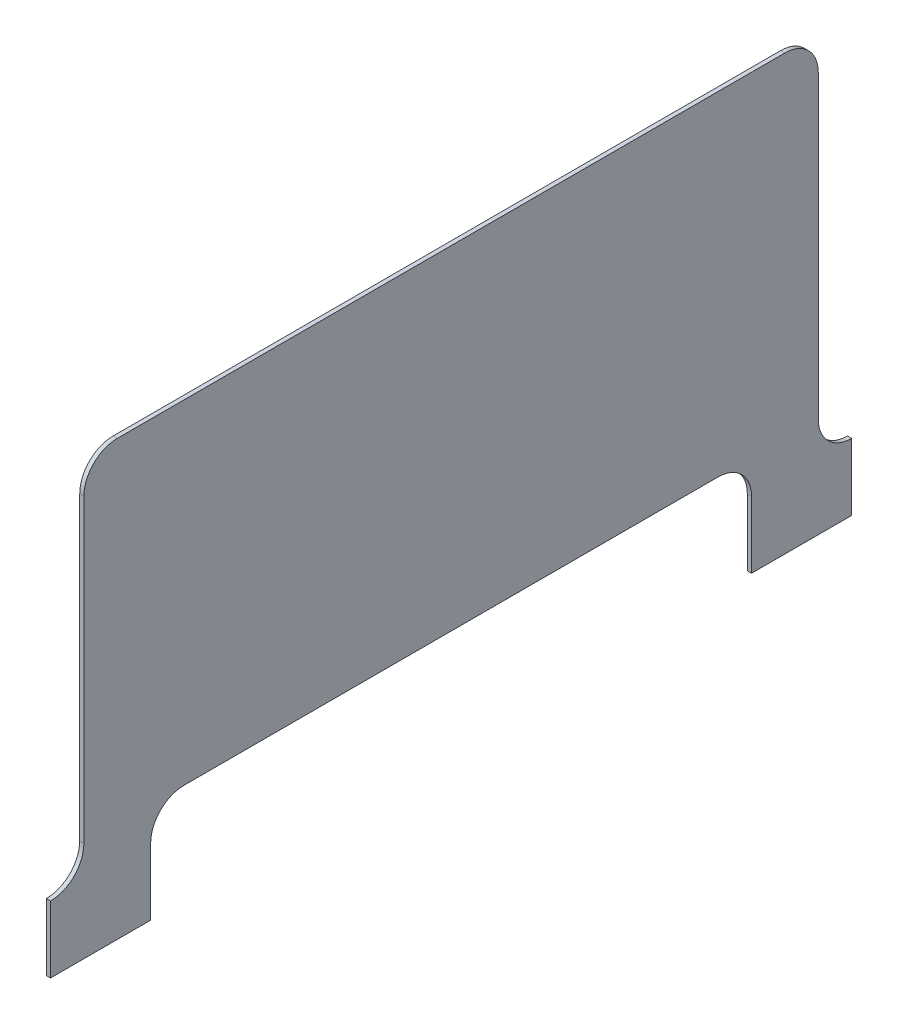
ISO-10303-21;
HEADER;
FILE_DESCRIPTION(('STEP AP214'),'2;1');
FILE_NAME('part.step','',(''),(''),'','','');
FILE_SCHEMA(('AUTOMOTIVE_DESIGN { 1 0 10303 214 1 1 1 1 }'));
ENDSEC;
DATA;
#1=APPLICATION_CONTEXT('core data for automotive mechanical design processes');
#2=APPLICATION_PROTOCOL_DEFINITION('international standard','automotive_design',2000,#1);
#3=PRODUCT_CONTEXT('',#1,'mechanical');
#4=PRODUCT('Part','Part','',(#3));
#5=PRODUCT_RELATED_PRODUCT_CATEGORY('part','',(#4));
#6=PRODUCT_DEFINITION_FORMATION('','',#4);
#7=PRODUCT_DEFINITION_CONTEXT('part definition',#1,'design');
#8=PRODUCT_DEFINITION('design','',#6,#7);
#9=PRODUCT_DEFINITION_SHAPE('','',#8);
#10=(LENGTH_UNIT() NAMED_UNIT(*) SI_UNIT(.MILLI.,.METRE.));
#11=(NAMED_UNIT(*) PLANE_ANGLE_UNIT() SI_UNIT($,.RADIAN.));
#12=(NAMED_UNIT(*) SI_UNIT($,.STERADIAN.) SOLID_ANGLE_UNIT());
#13=UNCERTAINTY_MEASURE_WITH_UNIT(LENGTH_MEASURE(1.E-05),#10,'distance_accuracy_value','');
#14=(GEOMETRIC_REPRESENTATION_CONTEXT(3) GLOBAL_UNCERTAINTY_ASSIGNED_CONTEXT((#13)) GLOBAL_UNIT_ASSIGNED_CONTEXT((#10,
#11,#12)) REPRESENTATION_CONTEXT('',''));
#15=CARTESIAN_POINT('',(0.,0.,0.));
#16=DIRECTION('',(0.,0.,1.));
#17=DIRECTION('',(1.,0.,0.));
#18=AXIS2_PLACEMENT_3D('',#15,#16,#17);
#19=CARTESIAN_POINT('',(-79.375,0.,304.8));
#20=DIRECTION('',(0.,1.,0.));
#21=DIRECTION('',(0.,0.,1.));
#22=AXIS2_PLACEMENT_3D('',#19,#20,#21);
#23=PLANE('',#22);
#24=DIRECTION('',(0.,0.,-1.));
#25=VECTOR('',#24,1.);
#26=CARTESIAN_POINT('',(-76.2,0.,304.8));
#27=LINE('',#26,#25);
#28=CARTESIAN_POINT('',(-76.1999999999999,0.,-228.6));
#29=VERTEX_POINT('',#28);
#30=CARTESIAN_POINT('',(-76.2,0.,-304.8));
#31=VERTEX_POINT('',#30);
#32=EDGE_CURVE('E149',#29,#31,#27,.T.);
#33=ORIENTED_EDGE('',*,*,#32,.F.);
#34=DIRECTION('',(-1.,0.,0.));
#35=VECTOR('',#34,1.);
#36=CARTESIAN_POINT('',(-76.1999999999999,0.,-228.6));
#37=LINE('',#36,#35);
#38=CARTESIAN_POINT('',(-79.375,0.,-228.6));
#39=VERTEX_POINT('',#38);
#40=EDGE_CURVE('E160',#29,#39,#37,.T.);
#41=ORIENTED_EDGE('',*,*,#40,.T.);
#42=DIRECTION('',(0.,0.,-1.));
#43=VECTOR('',#42,1.);
#44=CARTESIAN_POINT('',(-79.375,0.,304.8));
#45=LINE('',#44,#43);
#46=CARTESIAN_POINT('',(-79.375,0.,-304.8));
#47=VERTEX_POINT('',#46);
#48=EDGE_CURVE('E176',#39,#47,#45,.T.);
#49=ORIENTED_EDGE('',*,*,#48,.T.);
#50=DIRECTION('',(1.,0.,0.));
#51=VECTOR('',#50,1.);
#52=CARTESIAN_POINT('',(-79.375,0.,-304.8));
#53=LINE('',#52,#51);
#54=EDGE_CURVE('E170',#47,#31,#53,.T.);
#55=ORIENTED_EDGE('',*,*,#54,.T.);
#56=EDGE_LOOP('',(#33,#41,#49,#55));
#57=FACE_BOUND('',#56,.T.);
#58=ADVANCED_FACE('F31',(#57),#23,.F.);
#59=CARTESIAN_POINT('',(-79.375,330.2,304.8));
#60=DIRECTION('',(1.,0.,0.));
#61=DIRECTION('',(0.,1.,0.));
#62=AXIS2_PLACEMENT_3D('',#59,#60,#61);
#63=PLANE('',#62);
#64=DIRECTION('',(0.,0.,-1.));
#65=VECTOR('',#64,1.);
#66=CARTESIAN_POINT('',(-79.375,330.2,304.8));
#67=LINE('',#66,#65);
#68=CARTESIAN_POINT('',(-79.375,330.2,254.));
#69=VERTEX_POINT('',#68);
#70=CARTESIAN_POINT('',(-79.375,330.2,-254.));
#71=VERTEX_POINT('',#70);
#72=EDGE_CURVE('E178',#69,#71,#67,.T.);
#73=ORIENTED_EDGE('',*,*,#72,.T.);
#74=CARTESIAN_POINT('',(-79.375,304.8,-254.));
#75=DIRECTION('',(1.,0.,0.));
#76=DIRECTION('',(0.,1.,0.));
#77=AXIS2_PLACEMENT_3D('',#74,#75,#76);
#78=CIRCLE('',#77,25.4);
#79=CARTESIAN_POINT('',(-79.375,304.8,-279.4));
#80=VERTEX_POINT('',#79);
#81=EDGE_CURVE('E192',#71,#80,#78,.F.);
#82=ORIENTED_EDGE('',*,*,#81,.T.);
#83=DIRECTION('',(0.,1.,0.));
#84=VECTOR('',#83,1.);
#85=CARTESIAN_POINT('',(-79.375,330.2,-279.4));
#86=LINE('',#85,#84);
#87=CARTESIAN_POINT('',(-79.375,76.2,-279.4));
#88=VERTEX_POINT('',#87);
#89=EDGE_CURVE('E266',#88,#80,#86,.T.);
#90=ORIENTED_EDGE('',*,*,#89,.F.);
#91=CARTESIAN_POINT('',(-79.375,76.2,-304.8));
#92=DIRECTION('',(-1.,0.,0.));
#93=DIRECTION('',(0.,1.,0.));
#94=AXIS2_PLACEMENT_3D('',#91,#92,#93);
#95=CIRCLE('',#94,25.4);
#96=CARTESIAN_POINT('',(-79.375,50.8,-304.8));
#97=VERTEX_POINT('',#96);
#98=EDGE_CURVE('E260',#97,#88,#95,.T.);
#99=ORIENTED_EDGE('',*,*,#98,.F.);
#100=DIRECTION('',(0.,-1.,0.));
#101=VECTOR('',#100,1.);
#102=CARTESIAN_POINT('',(-79.375,330.2,-304.8));
#103=LINE('',#102,#101);
#104=EDGE_CURVE('E289',#97,#47,#103,.T.);
#105=ORIENTED_EDGE('',*,*,#104,.T.);
#106=ORIENTED_EDGE('',*,*,#48,.F.);
#107=DIRECTION('',(0.,-1.,0.));
#108=VECTOR('',#107,1.);
#109=CARTESIAN_POINT('',(-79.375,0.,-228.6));
#110=LINE('',#109,#108);
#111=CARTESIAN_POINT('',(-79.375,50.8,-228.6));
#112=VERTEX_POINT('',#111);
#113=EDGE_CURVE('E163',#112,#39,#110,.T.);
#114=ORIENTED_EDGE('',*,*,#113,.F.);
#115=CARTESIAN_POINT('',(-79.375,50.8,-203.2));
#116=DIRECTION('',(1.,0.,0.));
#117=DIRECTION('',(0.,1.,0.));
#118=AXIS2_PLACEMENT_3D('',#115,#116,#117);
#119=CIRCLE('',#118,25.4);
#120=CARTESIAN_POINT('',(-79.375,76.2,-203.2));
#121=VERTEX_POINT('',#120);
#122=EDGE_CURVE('E39',#112,#121,#119,.T.);
#123=ORIENTED_EDGE('',*,*,#122,.T.);
#124=DIRECTION('',(0.,0.,-1.));
#125=VECTOR('',#124,1.);
#126=CARTESIAN_POINT('',(-79.375,76.2,-228.6));
#127=LINE('',#126,#125);
#128=CARTESIAN_POINT('',(-79.375,76.2,203.2));
#129=VERTEX_POINT('',#128);
#130=EDGE_CURVE('E157',#129,#121,#127,.T.);
#131=ORIENTED_EDGE('',*,*,#130,.F.);
#132=CARTESIAN_POINT('',(-79.375,50.8,203.2));
#133=DIRECTION('',(1.,0.,0.));
#134=DIRECTION('',(0.,1.,0.));
#135=AXIS2_PLACEMENT_3D('',#132,#133,#134);
#136=CIRCLE('',#135,25.4);
#137=CARTESIAN_POINT('',(-79.375,50.8,228.6));
#138=VERTEX_POINT('',#137);
#139=EDGE_CURVE('E210',#129,#138,#136,.T.);
#140=ORIENTED_EDGE('',*,*,#139,.T.);
#141=DIRECTION('',(0.,1.,0.));
#142=VECTOR('',#141,1.);
#143=CARTESIAN_POINT('',(-79.375,0.,228.6));
#144=LINE('',#143,#142);
#145=CARTESIAN_POINT('',(-79.375,0.,228.6));
#146=VERTEX_POINT('',#145);
#147=EDGE_CURVE('E224',#146,#138,#144,.T.);
#148=ORIENTED_EDGE('',*,*,#147,.F.);
#149=CARTESIAN_POINT('',(-79.375,0.,304.8));
#150=VERTEX_POINT('',#149);
#151=EDGE_CURVE('E182',#150,#146,#45,.T.);
#152=ORIENTED_EDGE('',*,*,#151,.F.);
#153=DIRECTION('',(0.,-1.,0.));
#154=VECTOR('',#153,1.);
#155=CARTESIAN_POINT('',(-79.375,330.2,304.8));
#156=LINE('',#155,#154);
#157=CARTESIAN_POINT('',(-79.375,50.8000000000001,304.8));
#158=VERTEX_POINT('',#157);
#159=EDGE_CURVE('E255',#158,#150,#156,.T.);
#160=ORIENTED_EDGE('',*,*,#159,.F.);
#161=CARTESIAN_POINT('',(-79.375,76.2,304.8));
#162=DIRECTION('',(-1.,0.,0.));
#163=DIRECTION('',(0.,-1.,0.));
#164=AXIS2_PLACEMENT_3D('',#161,#162,#163);
#165=CIRCLE('',#164,25.4);
#166=CARTESIAN_POINT('',(-79.375,76.2,279.4));
#167=VERTEX_POINT('',#166);
#168=EDGE_CURVE('E280',#167,#158,#165,.T.);
#169=ORIENTED_EDGE('',*,*,#168,.F.);
#170=DIRECTION('',(0.,-1.,0.));
#171=VECTOR('',#170,1.);
#172=CARTESIAN_POINT('',(-79.375,330.2,279.4));
#173=LINE('',#172,#171);
#174=CARTESIAN_POINT('',(-79.375,304.8,279.4));
#175=VERTEX_POINT('',#174);
#176=EDGE_CURVE('E275',#175,#167,#173,.T.);
#177=ORIENTED_EDGE('',*,*,#176,.F.);
#178=CARTESIAN_POINT('',(-79.375,304.8,254.));
#179=DIRECTION('',(1.,0.,0.));
#180=DIRECTION('',(0.,1.,0.));
#181=AXIS2_PLACEMENT_3D('',#178,#179,#180);
#182=CIRCLE('',#181,25.4);
#183=EDGE_CURVE('E190',#175,#69,#182,.F.);
#184=ORIENTED_EDGE('',*,*,#183,.T.);
#185=EDGE_LOOP('',(#73,#82,#90,#99,#105,#106,#114,#123,#131,#140,#148,#152,#160,#169,#177,#184));
#186=FACE_BOUND('',#185,.T.);
#187=ADVANCED_FACE('F217',(#186),#63,.F.);
#188=ORIENTED_EDGE('',*,*,#151,.T.);
#189=DIRECTION('',(-1.,0.,0.));
#190=VECTOR('',#189,1.);
#191=CARTESIAN_POINT('',(-76.1999999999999,0.,228.6));
#192=LINE('',#191,#190);
#193=CARTESIAN_POINT('',(-76.1999999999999,0.,228.6));
#194=VERTEX_POINT('',#193);
#195=EDGE_CURVE('E166',#194,#146,#192,.T.);
#196=ORIENTED_EDGE('',*,*,#195,.F.);
#197=CARTESIAN_POINT('',(-76.2,0.,304.8));
#198=VERTEX_POINT('',#197);
#199=EDGE_CURVE('E172',#198,#194,#27,.T.);
#200=ORIENTED_EDGE('',*,*,#199,.F.);
#201=DIRECTION('',(1.,0.,0.));
#202=VECTOR('',#201,1.);
#203=CARTESIAN_POINT('',(-79.375,0.,304.8));
#204=LINE('',#203,#202);
#205=EDGE_CURVE('E251',#150,#198,#204,.T.);
#206=ORIENTED_EDGE('',*,*,#205,.F.);
#207=EDGE_LOOP('',(#188,#196,#200,#206));
#208=FACE_BOUND('',#207,.T.);
#209=ADVANCED_FACE('F235',(#208),#23,.F.);
#210=CARTESIAN_POINT('',(-76.2,330.2,304.8));
#211=DIRECTION('',(-1.,0.,0.));
#212=DIRECTION('',(0.,-1.,0.));
#213=AXIS2_PLACEMENT_3D('',#210,#211,#212);
#214=PLANE('',#213);
#215=DIRECTION('',(0.,1.,0.));
#216=VECTOR('',#215,1.);
#217=CARTESIAN_POINT('',(-76.2,330.2,-279.4));
#218=LINE('',#217,#216);
#219=CARTESIAN_POINT('',(-76.2,76.2,-279.4));
#220=VERTEX_POINT('',#219);
#221=CARTESIAN_POINT('',(-76.2,304.8,-279.4));
#222=VERTEX_POINT('',#221);
#223=EDGE_CURVE('E265',#220,#222,#218,.T.);
#224=ORIENTED_EDGE('',*,*,#223,.T.);
#225=CARTESIAN_POINT('',(-76.2,304.8,-254.));
#226=DIRECTION('',(-1.,0.,0.));
#227=DIRECTION('',(0.,-1.,0.));
#228=AXIS2_PLACEMENT_3D('',#225,#226,#227);
#229=CIRCLE('',#228,25.4);
#230=CARTESIAN_POINT('',(-76.2,330.2,-254.));
#231=VERTEX_POINT('',#230);
#232=EDGE_CURVE('E197',#222,#231,#229,.F.);
#233=ORIENTED_EDGE('',*,*,#232,.T.);
#234=DIRECTION('',(0.,0.,-1.));
#235=VECTOR('',#234,1.);
#236=CARTESIAN_POINT('',(-76.2,330.2,304.8));
#237=LINE('',#236,#235);
#238=CARTESIAN_POINT('',(-76.2,330.2,254.));
#239=VERTEX_POINT('',#238);
#240=EDGE_CURVE('E173',#239,#231,#237,.T.);
#241=ORIENTED_EDGE('',*,*,#240,.F.);
#242=CARTESIAN_POINT('',(-76.2,304.8,254.));
#243=DIRECTION('',(-1.,0.,0.));
#244=DIRECTION('',(0.,-1.,0.));
#245=AXIS2_PLACEMENT_3D('',#242,#243,#244);
#246=CIRCLE('',#245,25.4);
#247=CARTESIAN_POINT('',(-76.2,304.8,279.4));
#248=VERTEX_POINT('',#247);
#249=EDGE_CURVE('E54',#239,#248,#246,.F.);
#250=ORIENTED_EDGE('',*,*,#249,.T.);
#251=DIRECTION('',(0.,-1.,0.));
#252=VECTOR('',#251,1.);
#253=CARTESIAN_POINT('',(-76.2,330.2,279.4));
#254=LINE('',#253,#252);
#255=CARTESIAN_POINT('',(-76.2,76.2,279.4));
#256=VERTEX_POINT('',#255);
#257=EDGE_CURVE('E277',#248,#256,#254,.T.);
#258=ORIENTED_EDGE('',*,*,#257,.T.);
#259=CARTESIAN_POINT('',(-76.2,76.2,304.8));
#260=DIRECTION('',(-1.,0.,0.));
#261=DIRECTION('',(0.,-1.,0.));
#262=AXIS2_PLACEMENT_3D('',#259,#260,#261);
#263=CIRCLE('',#262,25.4);
#264=CARTESIAN_POINT('',(-76.2,50.7999999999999,304.8));
#265=VERTEX_POINT('',#264);
#266=EDGE_CURVE('E279',#256,#265,#263,.T.);
#267=ORIENTED_EDGE('',*,*,#266,.T.);
#268=DIRECTION('',(0.,1.,0.));
#269=VECTOR('',#268,1.);
#270=CARTESIAN_POINT('',(-76.2,330.2,304.8));
#271=LINE('',#270,#269);
#272=EDGE_CURVE('E295',#198,#265,#271,.T.);
#273=ORIENTED_EDGE('',*,*,#272,.F.);
#274=ORIENTED_EDGE('',*,*,#199,.T.);
#275=DIRECTION('',(0.,1.,0.));
#276=VECTOR('',#275,1.);
#277=CARTESIAN_POINT('',(-76.1999999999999,0.,228.6));
#278=LINE('',#277,#276);
#279=CARTESIAN_POINT('',(-76.1999999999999,50.8,228.6));
#280=VERTEX_POINT('',#279);
#281=EDGE_CURVE('E156',#194,#280,#278,.T.);
#282=ORIENTED_EDGE('',*,*,#281,.T.);
#283=CARTESIAN_POINT('',(-76.2,50.8,203.2));
#284=DIRECTION('',(-1.,0.,0.));
#285=DIRECTION('',(0.,-1.,0.));
#286=AXIS2_PLACEMENT_3D('',#283,#284,#285);
#287=CIRCLE('',#286,25.4);
#288=CARTESIAN_POINT('',(-76.1999999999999,76.2,203.2));
#289=VERTEX_POINT('',#288);
#290=EDGE_CURVE('E212',#280,#289,#287,.T.);
#291=ORIENTED_EDGE('',*,*,#290,.T.);
#292=DIRECTION('',(0.,0.,-1.));
#293=VECTOR('',#292,1.);
#294=CARTESIAN_POINT('',(-76.1999999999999,76.2,-228.6));
#295=LINE('',#294,#293);
#296=CARTESIAN_POINT('',(-76.1999999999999,76.2,-203.2));
#297=VERTEX_POINT('',#296);
#298=EDGE_CURVE('E167',#289,#297,#295,.T.);
#299=ORIENTED_EDGE('',*,*,#298,.T.);
#300=CARTESIAN_POINT('',(-76.2,50.8,-203.2));
#301=DIRECTION('',(-1.,0.,0.));
#302=DIRECTION('',(0.,-1.,0.));
#303=AXIS2_PLACEMENT_3D('',#300,#301,#302);
#304=CIRCLE('',#303,25.4);
#305=CARTESIAN_POINT('',(-76.1999999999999,50.8,-228.6));
#306=VERTEX_POINT('',#305);
#307=EDGE_CURVE('E11',#297,#306,#304,.T.);
#308=ORIENTED_EDGE('',*,*,#307,.T.);
#309=DIRECTION('',(0.,-1.,0.));
#310=VECTOR('',#309,1.);
#311=CARTESIAN_POINT('',(-76.1999999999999,0.,-228.6));
#312=LINE('',#311,#310);
#313=EDGE_CURVE('E143',#306,#29,#312,.T.);
#314=ORIENTED_EDGE('',*,*,#313,.T.);
#315=ORIENTED_EDGE('',*,*,#32,.T.);
#316=DIRECTION('',(0.,1.,0.));
#317=VECTOR('',#316,1.);
#318=CARTESIAN_POINT('',(-76.2,330.2,-304.8));
#319=LINE('',#318,#317);
#320=CARTESIAN_POINT('',(-76.2,50.8000000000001,-304.8));
#321=VERTEX_POINT('',#320);
#322=EDGE_CURVE('E293',#31,#321,#319,.T.);
#323=ORIENTED_EDGE('',*,*,#322,.T.);
#324=CARTESIAN_POINT('',(-76.2,76.2,-304.8));
#325=DIRECTION('',(-1.,0.,0.));
#326=DIRECTION('',(0.,1.,0.));
#327=AXIS2_PLACEMENT_3D('',#324,#325,#326);
#328=CIRCLE('',#327,25.4);
#329=EDGE_CURVE('E262',#321,#220,#328,.T.);
#330=ORIENTED_EDGE('',*,*,#329,.T.);
#331=EDGE_LOOP('',(#224,#233,#241,#250,#258,#267,#273,#274,#282,#291,#299,#308,#314,#315,#323,#330));
#332=FACE_BOUND('',#331,.T.);
#333=ADVANCED_FACE('F146',(#332),#214,.F.);
#334=CARTESIAN_POINT('',(-79.375,330.2,304.8));
#335=DIRECTION('',(0.,-1.,0.));
#336=DIRECTION('',(0.,0.,-1.));
#337=AXIS2_PLACEMENT_3D('',#334,#335,#336);
#338=PLANE('',#337);
#339=ORIENTED_EDGE('',*,*,#240,.T.);
#340=DIRECTION('',(-1.,0.,0.));
#341=VECTOR('',#340,1.);
#342=CARTESIAN_POINT('',(-79.375,330.2,-254.));
#343=LINE('',#342,#341);
#344=EDGE_CURVE('E187',#231,#71,#343,.T.);
#345=ORIENTED_EDGE('',*,*,#344,.T.);
#346=ORIENTED_EDGE('',*,*,#72,.F.);
#347=DIRECTION('',(-1.,0.,0.));
#348=VECTOR('',#347,1.);
#349=CARTESIAN_POINT('',(-79.375,330.2,254.));
#350=LINE('',#349,#348);
#351=EDGE_CURVE('E185',#69,#239,#350,.F.);
#352=ORIENTED_EDGE('',*,*,#351,.T.);
#353=EDGE_LOOP('',(#339,#345,#346,#352));
#354=FACE_BOUND('',#353,.T.);
#355=ADVANCED_FACE('F246',(#354),#338,.F.);
#356=CARTESIAN_POINT('',(-79.375,0.,304.8));
#357=DIRECTION('',(0.,0.,1.));
#358=DIRECTION('',(1.,0.,0.));
#359=AXIS2_PLACEMENT_3D('',#356,#357,#358);
#360=PLANE('',#359);
#361=DIRECTION('',(-1.,0.,0.));
#362=VECTOR('',#361,1.);
#363=CARTESIAN_POINT('',(-76.2,50.7999999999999,304.8));
#364=LINE('',#363,#362);
#365=EDGE_CURVE('E286',#265,#158,#364,.T.);
#366=ORIENTED_EDGE('',*,*,#365,.T.);
#367=ORIENTED_EDGE('',*,*,#159,.T.);
#368=ORIENTED_EDGE('',*,*,#205,.T.);
#369=ORIENTED_EDGE('',*,*,#272,.T.);
#370=EDGE_LOOP('',(#366,#367,#368,#369));
#371=FACE_BOUND('',#370,.T.);
#372=ADVANCED_FACE('F316',(#371),#360,.T.);
#373=CARTESIAN_POINT('',(-79.375,0.,-304.8));
#374=DIRECTION('',(0.,0.,1.));
#375=DIRECTION('',(1.,0.,0.));
#376=AXIS2_PLACEMENT_3D('',#373,#374,#375);
#377=PLANE('',#376);
#378=ORIENTED_EDGE('',*,*,#104,.F.);
#379=DIRECTION('',(-1.,0.,0.));
#380=VECTOR('',#379,1.);
#381=CARTESIAN_POINT('',(-76.2,50.8,-304.8));
#382=LINE('',#381,#380);
#383=EDGE_CURVE('E273',#321,#97,#382,.T.);
#384=ORIENTED_EDGE('',*,*,#383,.F.);
#385=ORIENTED_EDGE('',*,*,#322,.F.);
#386=ORIENTED_EDGE('',*,*,#54,.F.);
#387=EDGE_LOOP('',(#378,#384,#385,#386));
#388=FACE_BOUND('',#387,.T.);
#389=ADVANCED_FACE('F344',(#388),#377,.F.);
#390=CARTESIAN_POINT('',(-76.2,76.2,304.8));
#391=DIRECTION('',(-1.,0.,0.));
#392=DIRECTION('',(0.,-1.,0.));
#393=AXIS2_PLACEMENT_3D('',#390,#391,#392);
#394=CYLINDRICAL_SURFACE('',#393,25.4);
#395=ORIENTED_EDGE('',*,*,#168,.T.);
#396=ORIENTED_EDGE('',*,*,#365,.F.);
#397=ORIENTED_EDGE('',*,*,#266,.F.);
#398=DIRECTION('',(-1.,0.,0.));
#399=VECTOR('',#398,1.);
#400=CARTESIAN_POINT('',(-76.2,76.2,279.4));
#401=LINE('',#400,#399);
#402=EDGE_CURVE('E283',#256,#167,#401,.T.);
#403=ORIENTED_EDGE('',*,*,#402,.T.);
#404=EDGE_LOOP('',(#395,#396,#397,#403));
#405=FACE_BOUND('',#404,.T.);
#406=ADVANCED_FACE('F313',(#405),#394,.F.);
#407=CARTESIAN_POINT('',(-76.2,330.2,279.4));
#408=DIRECTION('',(0.,0.,-1.));
#409=DIRECTION('',(0.,1.,0.));
#410=AXIS2_PLACEMENT_3D('',#407,#408,#409);
#411=PLANE('',#410);
#412=ORIENTED_EDGE('',*,*,#257,.F.);
#413=DIRECTION('',(-1.,0.,0.));
#414=VECTOR('',#413,1.);
#415=CARTESIAN_POINT('',(-76.2,304.8,279.4));
#416=LINE('',#415,#414);
#417=EDGE_CURVE('E199',#248,#175,#416,.T.);
#418=ORIENTED_EDGE('',*,*,#417,.T.);
#419=ORIENTED_EDGE('',*,*,#176,.T.);
#420=ORIENTED_EDGE('',*,*,#402,.F.);
#421=EDGE_LOOP('',(#412,#418,#419,#420));
#422=FACE_BOUND('',#421,.T.);
#423=ADVANCED_FACE('F310',(#422),#411,.F.);
#424=CARTESIAN_POINT('',(-76.2,76.2,-304.8));
#425=DIRECTION('',(-1.,0.,0.));
#426=DIRECTION('',(0.,-1.,0.));
#427=AXIS2_PLACEMENT_3D('',#424,#425,#426);
#428=CYLINDRICAL_SURFACE('',#427,25.4);
#429=ORIENTED_EDGE('',*,*,#98,.T.);
#430=DIRECTION('',(-1.,0.,0.));
#431=VECTOR('',#430,1.);
#432=CARTESIAN_POINT('',(-76.2,76.2,-279.4));
#433=LINE('',#432,#431);
#434=EDGE_CURVE('E268',#220,#88,#433,.T.);
#435=ORIENTED_EDGE('',*,*,#434,.F.);
#436=ORIENTED_EDGE('',*,*,#329,.F.);
#437=ORIENTED_EDGE('',*,*,#383,.T.);
#438=EDGE_LOOP('',(#429,#435,#436,#437));
#439=FACE_BOUND('',#438,.T.);
#440=ADVANCED_FACE('F337',(#439),#428,.F.);
#441=CARTESIAN_POINT('',(-76.2,330.2,-279.4));
#442=DIRECTION('',(0.,0.,1.));
#443=DIRECTION('',(0.,-1.,0.));
#444=AXIS2_PLACEMENT_3D('',#441,#442,#443);
#445=PLANE('',#444);
#446=ORIENTED_EDGE('',*,*,#89,.T.);
#447=DIRECTION('',(-1.,0.,0.));
#448=VECTOR('',#447,1.);
#449=CARTESIAN_POINT('',(-76.2,304.8,-279.4));
#450=LINE('',#449,#448);
#451=EDGE_CURVE('E194',#80,#222,#450,.F.);
#452=ORIENTED_EDGE('',*,*,#451,.T.);
#453=ORIENTED_EDGE('',*,*,#223,.F.);
#454=ORIENTED_EDGE('',*,*,#434,.T.);
#455=EDGE_LOOP('',(#446,#452,#453,#454));
#456=FACE_BOUND('',#455,.T.);
#457=ADVANCED_FACE('F334',(#456),#445,.F.);
#458=CARTESIAN_POINT('',(-76.1999999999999,0.,-228.6));
#459=DIRECTION('',(0.,0.,-1.));
#460=DIRECTION('',(-1.,0.,0.));
#461=AXIS2_PLACEMENT_3D('',#458,#459,#460);
#462=PLANE('',#461);
#463=ORIENTED_EDGE('',*,*,#313,.F.);
#464=DIRECTION('',(-1.,0.,0.));
#465=VECTOR('',#464,1.);
#466=CARTESIAN_POINT('',(-79.375,50.8,-228.6));
#467=LINE('',#466,#465);
#468=EDGE_CURVE('E208',#306,#112,#467,.T.);
#469=ORIENTED_EDGE('',*,*,#468,.T.);
#470=ORIENTED_EDGE('',*,*,#113,.T.);
#471=ORIENTED_EDGE('',*,*,#40,.F.);
#472=EDGE_LOOP('',(#463,#469,#470,#471));
#473=FACE_BOUND('',#472,.T.);
#474=ADVANCED_FACE('F161',(#473),#462,.F.);
#475=CARTESIAN_POINT('',(-76.1999999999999,76.2,-228.6));
#476=DIRECTION('',(0.,1.,0.));
#477=DIRECTION('',(0.,0.,1.));
#478=AXIS2_PLACEMENT_3D('',#475,#476,#477);
#479=PLANE('',#478);
#480=ORIENTED_EDGE('',*,*,#298,.F.);
#481=DIRECTION('',(-1.,0.,0.));
#482=VECTOR('',#481,1.);
#483=CARTESIAN_POINT('',(-79.375,76.2,203.2));
#484=LINE('',#483,#482);
#485=EDGE_CURVE('E204',#289,#129,#484,.T.);
#486=ORIENTED_EDGE('',*,*,#485,.T.);
#487=ORIENTED_EDGE('',*,*,#130,.T.);
#488=DIRECTION('',(-1.,0.,0.));
#489=VECTOR('',#488,1.);
#490=CARTESIAN_POINT('',(-76.1999999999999,76.2,-203.2));
#491=LINE('',#490,#489);
#492=EDGE_CURVE('E202',#121,#297,#491,.F.);
#493=ORIENTED_EDGE('',*,*,#492,.T.);
#494=EDGE_LOOP('',(#480,#486,#487,#493));
#495=FACE_BOUND('',#494,.T.);
#496=ADVANCED_FACE('F222',(#495),#479,.F.);
#497=CARTESIAN_POINT('',(-76.1999999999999,0.,228.6));
#498=DIRECTION('',(0.,0.,1.));
#499=DIRECTION('',(0.,-1.,0.));
#500=AXIS2_PLACEMENT_3D('',#497,#498,#499);
#501=PLANE('',#500);
#502=ORIENTED_EDGE('',*,*,#147,.T.);
#503=DIRECTION('',(-1.,0.,0.));
#504=VECTOR('',#503,1.);
#505=CARTESIAN_POINT('',(-76.2,50.8,228.6));
#506=LINE('',#505,#504);
#507=EDGE_CURVE('E46',#138,#280,#506,.F.);
#508=ORIENTED_EDGE('',*,*,#507,.T.);
#509=ORIENTED_EDGE('',*,*,#281,.F.);
#510=ORIENTED_EDGE('',*,*,#195,.T.);
#511=EDGE_LOOP('',(#502,#508,#509,#510));
#512=FACE_BOUND('',#511,.T.);
#513=ADVANCED_FACE('F320',(#512),#501,.F.);
#514=CARTESIAN_POINT('',(-79.375,304.8,-254.));
#515=DIRECTION('',(-1.,0.,0.));
#516=DIRECTION('',(0.,0.,1.));
#517=AXIS2_PLACEMENT_3D('',#514,#515,#516);
#518=CYLINDRICAL_SURFACE('',#517,25.4);
#519=ORIENTED_EDGE('',*,*,#232,.F.);
#520=ORIENTED_EDGE('',*,*,#451,.F.);
#521=ORIENTED_EDGE('',*,*,#81,.F.);
#522=ORIENTED_EDGE('',*,*,#344,.F.);
#523=EDGE_LOOP('',(#519,#520,#521,#522));
#524=FACE_BOUND('',#523,.T.);
#525=ADVANCED_FACE('F322',(#524),#518,.T.);
#526=CARTESIAN_POINT('',(-76.2,304.8,254.));
#527=DIRECTION('',(-1.,0.,0.));
#528=DIRECTION('',(0.,0.,1.));
#529=AXIS2_PLACEMENT_3D('',#526,#527,#528);
#530=CYLINDRICAL_SURFACE('',#529,25.4);
#531=ORIENTED_EDGE('',*,*,#249,.F.);
#532=ORIENTED_EDGE('',*,*,#351,.F.);
#533=ORIENTED_EDGE('',*,*,#183,.F.);
#534=ORIENTED_EDGE('',*,*,#417,.F.);
#535=EDGE_LOOP('',(#531,#532,#533,#534));
#536=FACE_BOUND('',#535,.T.);
#537=ADVANCED_FACE('F231',(#536),#530,.T.);
#538=CARTESIAN_POINT('',(-76.1999999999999,50.8,203.2));
#539=DIRECTION('',(1.,0.,0.));
#540=DIRECTION('',(0.,1.,0.));
#541=AXIS2_PLACEMENT_3D('',#538,#539,#540);
#542=CYLINDRICAL_SURFACE('',#541,25.4);
#543=ORIENTED_EDGE('',*,*,#290,.F.);
#544=ORIENTED_EDGE('',*,*,#507,.F.);
#545=ORIENTED_EDGE('',*,*,#139,.F.);
#546=ORIENTED_EDGE('',*,*,#485,.F.);
#547=EDGE_LOOP('',(#543,#544,#545,#546));
#548=FACE_BOUND('',#547,.T.);
#549=ADVANCED_FACE('F227',(#548),#542,.F.);
#550=CARTESIAN_POINT('',(-76.1999999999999,50.8,-203.2));
#551=DIRECTION('',(1.,0.,0.));
#552=DIRECTION('',(0.,1.,0.));
#553=AXIS2_PLACEMENT_3D('',#550,#551,#552);
#554=CYLINDRICAL_SURFACE('',#553,25.4);
#555=ORIENTED_EDGE('',*,*,#307,.F.);
#556=ORIENTED_EDGE('',*,*,#492,.F.);
#557=ORIENTED_EDGE('',*,*,#122,.F.);
#558=ORIENTED_EDGE('',*,*,#468,.F.);
#559=EDGE_LOOP('',(#555,#556,#557,#558));
#560=FACE_BOUND('',#559,.T.);
#561=ADVANCED_FACE('F33',(#560),#554,.F.);
#562=CLOSED_SHELL('',(#58,#187,#209,#333,#355,#372,#389,#406,#423,#440,#457,#474,#496,#513,#525,
#537,#549,#561));
#563=MANIFOLD_SOLID_BREP('B2',#562);
#564=ADVANCED_BREP_SHAPE_REPRESENTATION('',(#18,#563),#14);
#565=SHAPE_DEFINITION_REPRESENTATION(#9,#564);
ENDSEC;
END-ISO-10303-21;
